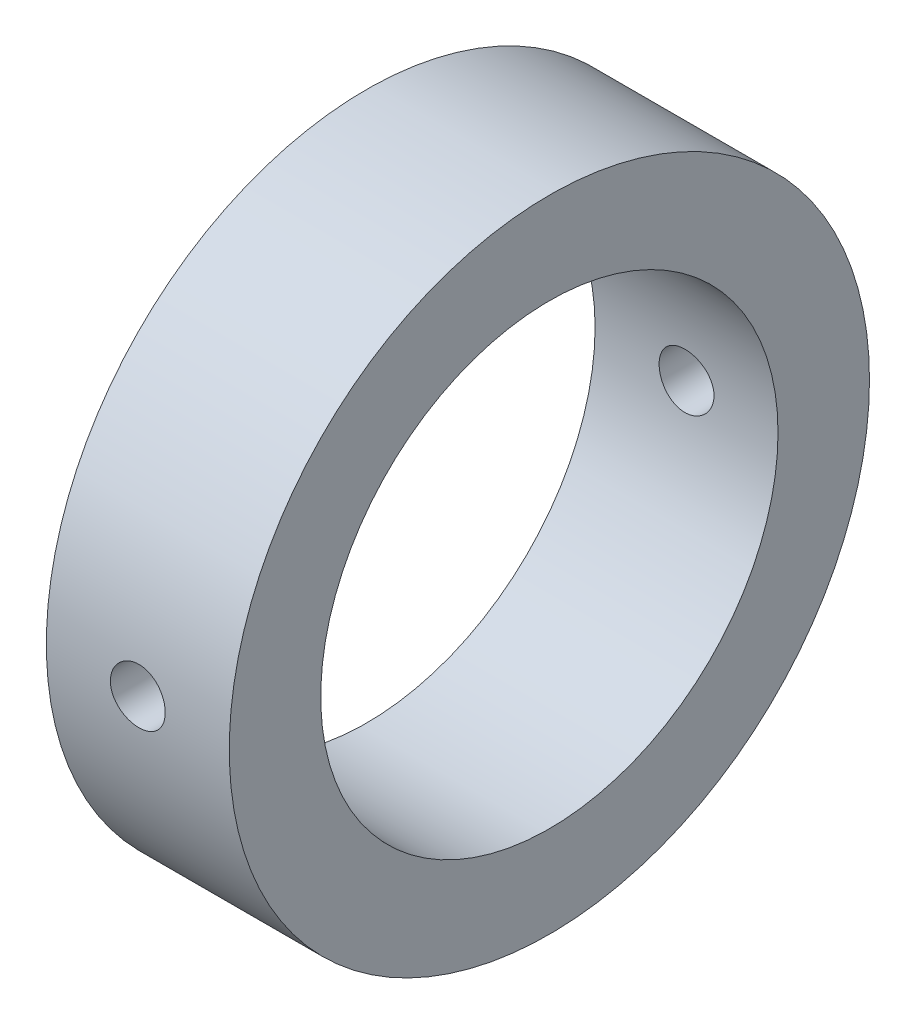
from build123d import *

# Parameters (mm, degrees)
SKETCH1_R               = 35
SKETCH1_R_2             = 25
BOSS_EXTRUDE1_DEPTH     = 20
CUT_EXTRUDE1_DEPTH      = 54.38539126
CUT_EXTRUDE1_DEPTH_BACK = 54.38539126
SKETCH2_R               = 3


with BuildPart() as part:
    # Sketch1 → Boss-Extrude1 (new body)
    with BuildSketch(Plane.YZ):
        with Locations(Location((0, 0, 0), (0, 0, 270))):
            Circle(SKETCH1_R)
        with Locations(Location((0, 0, 0), (0, 0, 270))):
            Circle(SKETCH1_R_2, mode=Mode.SUBTRACT)
    extrude(amount=BOSS_EXTRUDE1_DEPTH)

    # Sketch2 → Cut-Extrude1 (cut, two sides: drawn at the far end of the back side and taken through both)
    with BuildSketch(Plane(origin=(0, 0, 0), x_dir=(0, 1, 0), z_dir=(0, 0, 1)).offset(-CUT_EXTRUDE1_DEPTH_BACK)):
        with Locations(Location((0, -10, 0), (0, 0, 270))):
            Circle(SKETCH2_R)
    extrude(amount=CUT_EXTRUDE1_DEPTH + CUT_EXTRUDE1_DEPTH_BACK, mode=Mode.SUBTRACT)


solid = part.part
